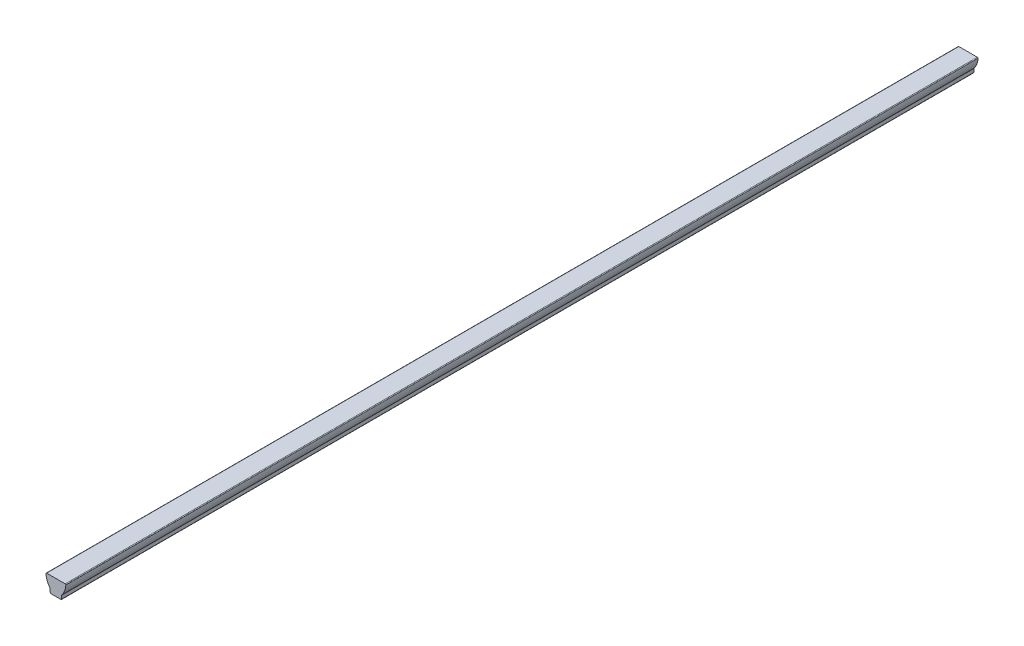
ISO-10303-21;
HEADER;
FILE_DESCRIPTION(('STEP AP214'),'2;1');
FILE_NAME('part.step','',(''),(''),'','','');
FILE_SCHEMA(('AUTOMOTIVE_DESIGN { 1 0 10303 214 1 1 1 1 }'));
ENDSEC;
DATA;
#1=APPLICATION_CONTEXT('core data for automotive mechanical design processes');
#2=APPLICATION_PROTOCOL_DEFINITION('international standard','automotive_design',2000,#1);
#3=PRODUCT_CONTEXT('',#1,'mechanical');
#4=PRODUCT('Part','Part','',(#3));
#5=PRODUCT_RELATED_PRODUCT_CATEGORY('part','',(#4));
#6=PRODUCT_DEFINITION_FORMATION('','',#4);
#7=PRODUCT_DEFINITION_CONTEXT('part definition',#1,'design');
#8=PRODUCT_DEFINITION('design','',#6,#7);
#9=PRODUCT_DEFINITION_SHAPE('','',#8);
#10=(LENGTH_UNIT() NAMED_UNIT(*) SI_UNIT(.MILLI.,.METRE.));
#11=(NAMED_UNIT(*) PLANE_ANGLE_UNIT() SI_UNIT($,.RADIAN.));
#12=(NAMED_UNIT(*) SI_UNIT($,.STERADIAN.) SOLID_ANGLE_UNIT());
#13=UNCERTAINTY_MEASURE_WITH_UNIT(LENGTH_MEASURE(1.E-05),#10,'distance_accuracy_value','');
#14=(GEOMETRIC_REPRESENTATION_CONTEXT(3) GLOBAL_UNCERTAINTY_ASSIGNED_CONTEXT((#13)) GLOBAL_UNIT_ASSIGNED_CONTEXT((#10,
#11,#12)) REPRESENTATION_CONTEXT('',''));
#15=CARTESIAN_POINT('',(0.,0.,0.));
#16=DIRECTION('',(0.,0.,1.));
#17=DIRECTION('',(1.,0.,0.));
#18=AXIS2_PLACEMENT_3D('',#15,#16,#17);
#19=CARTESIAN_POINT('',(-5.14847834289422,8.3566,508.));
#20=DIRECTION('',(0.,0.,-1.));
#21=DIRECTION('',(-1.,0.,0.));
#22=AXIS2_PLACEMENT_3D('',#19,#20,#21);
#23=CYLINDRICAL_SURFACE('',#22,0.381);
#24=CARTESIAN_POINT('',(-5.14847834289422,8.3566,0.));
#25=DIRECTION('',(0.,0.,1.));
#26=DIRECTION('',(-1.,0.,0.));
#27=AXIS2_PLACEMENT_3D('',#24,#25,#26);
#28=CIRCLE('',#27,0.381);
#29=CARTESIAN_POINT('',(-5.14847834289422,8.7376,0.));
#30=VERTEX_POINT('',#29);
#31=CARTESIAN_POINT('',(-5.52916548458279,8.34116302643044,0.));
#32=VERTEX_POINT('',#31);
#33=EDGE_CURVE('E106',#30,#32,#28,.T.);
#34=ORIENTED_EDGE('',*,*,#33,.T.);
#35=DIRECTION('',(0.,0.,-1.));
#36=VECTOR('',#35,1.);
#37=CARTESIAN_POINT('',(-5.52916548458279,8.34116302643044,508.));
#38=LINE('',#37,#36);
#39=CARTESIAN_POINT('',(-5.52916548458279,8.34116302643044,508.));
#40=VERTEX_POINT('',#39);
#41=EDGE_CURVE('E9',#40,#32,#38,.T.);
#42=ORIENTED_EDGE('',*,*,#41,.F.);
#43=CARTESIAN_POINT('',(-5.14847834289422,8.3566,508.));
#44=DIRECTION('',(0.,0.,1.));
#45=DIRECTION('',(-1.,0.,0.));
#46=AXIS2_PLACEMENT_3D('',#43,#44,#45);
#47=CIRCLE('',#46,0.381);
#48=CARTESIAN_POINT('',(-5.14847834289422,8.7376,508.));
#49=VERTEX_POINT('',#48);
#50=EDGE_CURVE('E141',#49,#40,#47,.T.);
#51=ORIENTED_EDGE('',*,*,#50,.F.);
#52=DIRECTION('',(0.,0.,-1.));
#53=VECTOR('',#52,1.);
#54=CARTESIAN_POINT('',(-5.14847834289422,8.7376,508.));
#55=LINE('',#54,#53);
#56=EDGE_CURVE('E119',#49,#30,#55,.T.);
#57=ORIENTED_EDGE('',*,*,#56,.T.);
#58=EDGE_LOOP('',(#34,#42,#51,#57));
#59=FACE_BOUND('',#58,.T.);
#60=ADVANCED_FACE('F14',(#59),#23,.T.);
#61=CARTESIAN_POINT('',(4.2472623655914,8.7376,508.));
#62=DIRECTION('',(0.,0.,-1.));
#63=DIRECTION('',(-1.,0.,0.));
#64=AXIS2_PLACEMENT_3D('',#61,#62,#63);
#65=CYLINDRICAL_SURFACE('',#64,9.7844623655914);
#66=CARTESIAN_POINT('',(4.2472623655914,8.7376,0.));
#67=DIRECTION('',(0.,0.,1.));
#68=DIRECTION('',(1.,0.,0.));
#69=AXIS2_PLACEMENT_3D('',#66,#67,#68);
#70=CIRCLE('',#69,9.7844623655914);
#71=CARTESIAN_POINT('',(-3.26353490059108,2.46674453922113,0.));
#72=VERTEX_POINT('',#71);
#73=EDGE_CURVE('E102',#32,#72,#70,.T.);
#74=ORIENTED_EDGE('',*,*,#73,.T.);
#75=DIRECTION('',(0.,0.,-1.));
#76=VECTOR('',#75,1.);
#77=CARTESIAN_POINT('',(-3.26353490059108,2.46674453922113,508.));
#78=LINE('',#77,#76);
#79=CARTESIAN_POINT('',(-3.26353490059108,2.46674453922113,508.));
#80=VERTEX_POINT('',#79);
#81=EDGE_CURVE('E21',#80,#72,#78,.T.);
#82=ORIENTED_EDGE('',*,*,#81,.F.);
#83=CARTESIAN_POINT('',(4.2472623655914,8.7376,508.));
#84=DIRECTION('',(0.,0.,1.));
#85=DIRECTION('',(1.,0.,0.));
#86=AXIS2_PLACEMENT_3D('',#83,#84,#85);
#87=CIRCLE('',#86,9.7844623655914);
#88=EDGE_CURVE('E115',#40,#80,#87,.T.);
#89=ORIENTED_EDGE('',*,*,#88,.F.);
#90=ORIENTED_EDGE('',*,*,#41,.T.);
#91=EDGE_LOOP('',(#74,#82,#89,#90));
#92=FACE_BOUND('',#91,.T.);
#93=ADVANCED_FACE('F114',(#92),#65,.T.);
#94=CARTESIAN_POINT('',(-3.556,2.22256189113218,508.));
#95=DIRECTION('',(0.,0.,-1.));
#96=DIRECTION('',(-1.,0.,0.));
#97=AXIS2_PLACEMENT_3D('',#94,#95,#96);
#98=CYLINDRICAL_SURFACE('',#97,0.381);
#99=CARTESIAN_POINT('',(-3.556,2.22256189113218,0.));
#100=DIRECTION('',(0.,0.,-1.));
#101=DIRECTION('',(-1.,0.,0.));
#102=AXIS2_PLACEMENT_3D('',#99,#100,#101);
#103=CIRCLE('',#102,0.381);
#104=CARTESIAN_POINT('',(-3.175,2.22256189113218,0.));
#105=VERTEX_POINT('',#104);
#106=EDGE_CURVE('E108',#72,#105,#103,.T.);
#107=ORIENTED_EDGE('',*,*,#106,.T.);
#108=DIRECTION('',(0.,0.,-1.));
#109=VECTOR('',#108,1.);
#110=CARTESIAN_POINT('',(-3.175,2.22256189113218,508.));
#111=LINE('',#110,#109);
#112=CARTESIAN_POINT('',(-3.175,2.22256189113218,508.));
#113=VERTEX_POINT('',#112);
#114=EDGE_CURVE('E187',#113,#105,#111,.T.);
#115=ORIENTED_EDGE('',*,*,#114,.F.);
#116=CARTESIAN_POINT('',(-3.556,2.22256189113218,508.));
#117=DIRECTION('',(0.,0.,-1.));
#118=DIRECTION('',(-1.,0.,0.));
#119=AXIS2_PLACEMENT_3D('',#116,#117,#118);
#120=CIRCLE('',#119,0.381);
#121=EDGE_CURVE('E144',#80,#113,#120,.T.);
#122=ORIENTED_EDGE('',*,*,#121,.F.);
#123=ORIENTED_EDGE('',*,*,#81,.T.);
#124=EDGE_LOOP('',(#107,#115,#122,#123));
#125=FACE_BOUND('',#124,.T.);
#126=ADVANCED_FACE('F191',(#125),#98,.F.);
#127=CARTESIAN_POINT('',(-3.175,0.381,508.));
#128=DIRECTION('',(1.,0.,0.));
#129=DIRECTION('',(0.,1.,0.));
#130=AXIS2_PLACEMENT_3D('',#127,#128,#129);
#131=PLANE('',#130);
#132=DIRECTION('',(0.,-1.,0.));
#133=VECTOR('',#132,1.);
#134=CARTESIAN_POINT('',(-3.175,0.381,0.));
#135=LINE('',#134,#133);
#136=CARTESIAN_POINT('',(-3.175,0.381,0.));
#137=VERTEX_POINT('',#136);
#138=EDGE_CURVE('E123',#105,#137,#135,.T.);
#139=ORIENTED_EDGE('',*,*,#138,.T.);
#140=DIRECTION('',(0.,0.,-1.));
#141=VECTOR('',#140,1.);
#142=CARTESIAN_POINT('',(-3.175,0.381,508.));
#143=LINE('',#142,#141);
#144=CARTESIAN_POINT('',(-3.175,0.381,508.));
#145=VERTEX_POINT('',#144);
#146=EDGE_CURVE('E184',#145,#137,#143,.T.);
#147=ORIENTED_EDGE('',*,*,#146,.F.);
#148=DIRECTION('',(0.,-1.,0.));
#149=VECTOR('',#148,1.);
#150=CARTESIAN_POINT('',(-3.175,0.381,508.));
#151=LINE('',#150,#149);
#152=EDGE_CURVE('E146',#113,#145,#151,.T.);
#153=ORIENTED_EDGE('',*,*,#152,.F.);
#154=ORIENTED_EDGE('',*,*,#114,.T.);
#155=EDGE_LOOP('',(#139,#147,#153,#154));
#156=FACE_BOUND('',#155,.T.);
#157=ADVANCED_FACE('F199',(#156),#131,.F.);
#158=CARTESIAN_POINT('',(-2.794,0.381,508.));
#159=DIRECTION('',(0.,0.,-1.));
#160=DIRECTION('',(-1.,0.,0.));
#161=AXIS2_PLACEMENT_3D('',#158,#159,#160);
#162=CYLINDRICAL_SURFACE('',#161,0.381);
#163=CARTESIAN_POINT('',(-2.794,0.381,0.));
#164=DIRECTION('',(0.,0.,1.));
#165=DIRECTION('',(1.,0.,0.));
#166=AXIS2_PLACEMENT_3D('',#163,#164,#165);
#167=CIRCLE('',#166,0.381);
#168=CARTESIAN_POINT('',(-2.794,0.,0.));
#169=VERTEX_POINT('',#168);
#170=EDGE_CURVE('E125',#137,#169,#167,.T.);
#171=ORIENTED_EDGE('',*,*,#170,.T.);
#172=DIRECTION('',(0.,0.,-1.));
#173=VECTOR('',#172,1.);
#174=CARTESIAN_POINT('',(-2.794,0.,508.));
#175=LINE('',#174,#173);
#176=CARTESIAN_POINT('',(-2.794,0.,508.));
#177=VERTEX_POINT('',#176);
#178=EDGE_CURVE('E181',#177,#169,#175,.T.);
#179=ORIENTED_EDGE('',*,*,#178,.F.);
#180=CARTESIAN_POINT('',(-2.794,0.381,508.));
#181=DIRECTION('',(0.,0.,1.));
#182=DIRECTION('',(1.,0.,0.));
#183=AXIS2_PLACEMENT_3D('',#180,#181,#182);
#184=CIRCLE('',#183,0.381);
#185=EDGE_CURVE('E148',#145,#177,#184,.T.);
#186=ORIENTED_EDGE('',*,*,#185,.F.);
#187=ORIENTED_EDGE('',*,*,#146,.T.);
#188=EDGE_LOOP('',(#171,#179,#186,#187));
#189=FACE_BOUND('',#188,.T.);
#190=ADVANCED_FACE('F202',(#189),#162,.T.);
#191=CARTESIAN_POINT('',(-2.794,0.,508.));
#192=DIRECTION('',(0.,1.,0.));
#193=DIRECTION('',(0.,0.,1.));
#194=AXIS2_PLACEMENT_3D('',#191,#192,#193);
#195=PLANE('',#194);
#196=DIRECTION('',(1.,0.,0.));
#197=VECTOR('',#196,1.);
#198=CARTESIAN_POINT('',(-2.794,0.,0.));
#199=LINE('',#198,#197);
#200=CARTESIAN_POINT('',(2.794,0.,0.));
#201=VERTEX_POINT('',#200);
#202=EDGE_CURVE('E127',#169,#201,#199,.T.);
#203=ORIENTED_EDGE('',*,*,#202,.T.);
#204=DIRECTION('',(0.,0.,-1.));
#205=VECTOR('',#204,1.);
#206=CARTESIAN_POINT('',(2.794,0.,508.));
#207=LINE('',#206,#205);
#208=CARTESIAN_POINT('',(2.794,0.,508.));
#209=VERTEX_POINT('',#208);
#210=EDGE_CURVE('E178',#209,#201,#207,.T.);
#211=ORIENTED_EDGE('',*,*,#210,.F.);
#212=DIRECTION('',(1.,0.,0.));
#213=VECTOR('',#212,1.);
#214=CARTESIAN_POINT('',(-2.794,0.,508.));
#215=LINE('',#214,#213);
#216=EDGE_CURVE('E150',#177,#209,#215,.T.);
#217=ORIENTED_EDGE('',*,*,#216,.F.);
#218=ORIENTED_EDGE('',*,*,#178,.T.);
#219=EDGE_LOOP('',(#203,#211,#217,#218));
#220=FACE_BOUND('',#219,.T.);
#221=ADVANCED_FACE('F207',(#220),#195,.F.);
#222=CARTESIAN_POINT('',(2.794,0.381,508.));
#223=DIRECTION('',(0.,0.,-1.));
#224=DIRECTION('',(-1.,0.,0.));
#225=AXIS2_PLACEMENT_3D('',#222,#223,#224);
#226=CYLINDRICAL_SURFACE('',#225,0.381);
#227=CARTESIAN_POINT('',(2.794,0.381,0.));
#228=DIRECTION('',(0.,0.,1.));
#229=DIRECTION('',(1.,0.,0.));
#230=AXIS2_PLACEMENT_3D('',#227,#228,#229);
#231=CIRCLE('',#230,0.381);
#232=CARTESIAN_POINT('',(3.175,0.381,0.));
#233=VERTEX_POINT('',#232);
#234=EDGE_CURVE('E129',#201,#233,#231,.T.);
#235=ORIENTED_EDGE('',*,*,#234,.T.);
#236=DIRECTION('',(0.,0.,-1.));
#237=VECTOR('',#236,1.);
#238=CARTESIAN_POINT('',(3.175,0.381,508.));
#239=LINE('',#238,#237);
#240=CARTESIAN_POINT('',(3.175,0.381,508.));
#241=VERTEX_POINT('',#240);
#242=EDGE_CURVE('E175',#241,#233,#239,.T.);
#243=ORIENTED_EDGE('',*,*,#242,.F.);
#244=CARTESIAN_POINT('',(2.794,0.381,508.));
#245=DIRECTION('',(0.,0.,1.));
#246=DIRECTION('',(1.,0.,0.));
#247=AXIS2_PLACEMENT_3D('',#244,#245,#246);
#248=CIRCLE('',#247,0.381);
#249=EDGE_CURVE('E152',#209,#241,#248,.T.);
#250=ORIENTED_EDGE('',*,*,#249,.F.);
#251=ORIENTED_EDGE('',*,*,#210,.T.);
#252=EDGE_LOOP('',(#235,#243,#250,#251));
#253=FACE_BOUND('',#252,.T.);
#254=ADVANCED_FACE('F213',(#253),#226,.T.);
#255=CARTESIAN_POINT('',(3.175,0.381,508.));
#256=DIRECTION('',(-1.,0.,0.));
#257=DIRECTION('',(0.,-1.,0.));
#258=AXIS2_PLACEMENT_3D('',#255,#256,#257);
#259=PLANE('',#258);
#260=DIRECTION('',(0.,1.,0.));
#261=VECTOR('',#260,1.);
#262=CARTESIAN_POINT('',(3.175,0.381,0.));
#263=LINE('',#262,#261);
#264=CARTESIAN_POINT('',(3.175,2.22256189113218,0.));
#265=VERTEX_POINT('',#264);
#266=EDGE_CURVE('E131',#233,#265,#263,.T.);
#267=ORIENTED_EDGE('',*,*,#266,.T.);
#268=DIRECTION('',(0.,0.,-1.));
#269=VECTOR('',#268,1.);
#270=CARTESIAN_POINT('',(3.175,2.22256189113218,508.));
#271=LINE('',#270,#269);
#272=CARTESIAN_POINT('',(3.175,2.22256189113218,508.));
#273=VERTEX_POINT('',#272);
#274=EDGE_CURVE('E172',#273,#265,#271,.T.);
#275=ORIENTED_EDGE('',*,*,#274,.F.);
#276=DIRECTION('',(0.,1.,0.));
#277=VECTOR('',#276,1.);
#278=CARTESIAN_POINT('',(3.175,0.381,508.));
#279=LINE('',#278,#277);
#280=EDGE_CURVE('E154',#241,#273,#279,.T.);
#281=ORIENTED_EDGE('',*,*,#280,.F.);
#282=ORIENTED_EDGE('',*,*,#242,.T.);
#283=EDGE_LOOP('',(#267,#275,#281,#282));
#284=FACE_BOUND('',#283,.T.);
#285=ADVANCED_FACE('F217',(#284),#259,.F.);
#286=CARTESIAN_POINT('',(3.556,2.22256189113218,508.));
#287=DIRECTION('',(0.,0.,-1.));
#288=DIRECTION('',(-1.,0.,0.));
#289=AXIS2_PLACEMENT_3D('',#286,#287,#288);
#290=CYLINDRICAL_SURFACE('',#289,0.381);
#291=CARTESIAN_POINT('',(3.556,2.22256189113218,0.));
#292=DIRECTION('',(0.,0.,-1.));
#293=DIRECTION('',(-1.,0.,0.));
#294=AXIS2_PLACEMENT_3D('',#291,#292,#293);
#295=CIRCLE('',#294,0.381);
#296=CARTESIAN_POINT('',(3.26353490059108,2.46674453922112,0.));
#297=VERTEX_POINT('',#296);
#298=EDGE_CURVE('E133',#265,#297,#295,.T.);
#299=ORIENTED_EDGE('',*,*,#298,.T.);
#300=DIRECTION('',(0.,0.,-1.));
#301=VECTOR('',#300,1.);
#302=CARTESIAN_POINT('',(3.26353490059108,2.46674453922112,508.));
#303=LINE('',#302,#301);
#304=CARTESIAN_POINT('',(3.26353490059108,2.46674453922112,508.));
#305=VERTEX_POINT('',#304);
#306=EDGE_CURVE('E169',#305,#297,#303,.T.);
#307=ORIENTED_EDGE('',*,*,#306,.F.);
#308=CARTESIAN_POINT('',(3.556,2.22256189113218,508.));
#309=DIRECTION('',(0.,0.,-1.));
#310=DIRECTION('',(-1.,0.,0.));
#311=AXIS2_PLACEMENT_3D('',#308,#309,#310);
#312=CIRCLE('',#311,0.381);
#313=EDGE_CURVE('E156',#273,#305,#312,.T.);
#314=ORIENTED_EDGE('',*,*,#313,.F.);
#315=ORIENTED_EDGE('',*,*,#274,.T.);
#316=EDGE_LOOP('',(#299,#307,#314,#315));
#317=FACE_BOUND('',#316,.T.);
#318=ADVANCED_FACE('F222',(#317),#290,.F.);
#319=CARTESIAN_POINT('',(-4.2472623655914,8.7376,508.));
#320=DIRECTION('',(0.,0.,-1.));
#321=DIRECTION('',(-1.,0.,0.));
#322=AXIS2_PLACEMENT_3D('',#319,#320,#321);
#323=CYLINDRICAL_SURFACE('',#322,9.7844623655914);
#324=CARTESIAN_POINT('',(-4.2472623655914,8.7376,0.));
#325=DIRECTION('',(0.,0.,1.));
#326=DIRECTION('',(-1.,0.,0.));
#327=AXIS2_PLACEMENT_3D('',#324,#325,#326);
#328=CIRCLE('',#327,9.7844623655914);
#329=CARTESIAN_POINT('',(5.52916548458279,8.34116302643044,0.));
#330=VERTEX_POINT('',#329);
#331=EDGE_CURVE('E135',#297,#330,#328,.T.);
#332=ORIENTED_EDGE('',*,*,#331,.T.);
#333=DIRECTION('',(0.,0.,-1.));
#334=VECTOR('',#333,1.);
#335=CARTESIAN_POINT('',(5.52916548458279,8.34116302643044,508.));
#336=LINE('',#335,#334);
#337=CARTESIAN_POINT('',(5.52916548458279,8.34116302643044,508.));
#338=VERTEX_POINT('',#337);
#339=EDGE_CURVE('E166',#338,#330,#336,.T.);
#340=ORIENTED_EDGE('',*,*,#339,.F.);
#341=CARTESIAN_POINT('',(-4.2472623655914,8.7376,508.));
#342=DIRECTION('',(0.,0.,1.));
#343=DIRECTION('',(-1.,0.,0.));
#344=AXIS2_PLACEMENT_3D('',#341,#342,#343);
#345=CIRCLE('',#344,9.7844623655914);
#346=EDGE_CURVE('E158',#305,#338,#345,.T.);
#347=ORIENTED_EDGE('',*,*,#346,.F.);
#348=ORIENTED_EDGE('',*,*,#306,.T.);
#349=EDGE_LOOP('',(#332,#340,#347,#348));
#350=FACE_BOUND('',#349,.T.);
#351=ADVANCED_FACE('F226',(#350),#323,.T.);
#352=CARTESIAN_POINT('',(5.14847834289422,8.3566,508.));
#353=DIRECTION('',(0.,0.,-1.));
#354=DIRECTION('',(-1.,0.,0.));
#355=AXIS2_PLACEMENT_3D('',#352,#353,#354);
#356=CYLINDRICAL_SURFACE('',#355,0.381);
#357=CARTESIAN_POINT('',(5.14847834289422,8.3566,0.));
#358=DIRECTION('',(0.,0.,1.));
#359=DIRECTION('',(-1.,0.,0.));
#360=AXIS2_PLACEMENT_3D('',#357,#358,#359);
#361=CIRCLE('',#360,0.381);
#362=CARTESIAN_POINT('',(5.14847834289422,8.7376,0.));
#363=VERTEX_POINT('',#362);
#364=EDGE_CURVE('E137',#330,#363,#361,.T.);
#365=ORIENTED_EDGE('',*,*,#364,.T.);
#366=DIRECTION('',(0.,0.,-1.));
#367=VECTOR('',#366,1.);
#368=CARTESIAN_POINT('',(5.14847834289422,8.7376,508.));
#369=LINE('',#368,#367);
#370=CARTESIAN_POINT('',(5.14847834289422,8.7376,508.));
#371=VERTEX_POINT('',#370);
#372=EDGE_CURVE('E163',#371,#363,#369,.T.);
#373=ORIENTED_EDGE('',*,*,#372,.F.);
#374=CARTESIAN_POINT('',(5.14847834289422,8.3566,508.));
#375=DIRECTION('',(0.,0.,1.));
#376=DIRECTION('',(-1.,0.,0.));
#377=AXIS2_PLACEMENT_3D('',#374,#375,#376);
#378=CIRCLE('',#377,0.381);
#379=EDGE_CURVE('E33',#338,#371,#378,.T.);
#380=ORIENTED_EDGE('',*,*,#379,.F.);
#381=ORIENTED_EDGE('',*,*,#339,.T.);
#382=EDGE_LOOP('',(#365,#373,#380,#381));
#383=FACE_BOUND('',#382,.T.);
#384=ADVANCED_FACE('F230',(#383),#356,.T.);
#385=CARTESIAN_POINT('',(-5.14847834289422,8.7376,508.));
#386=DIRECTION('',(0.,-1.,0.));
#387=DIRECTION('',(0.,0.,-1.));
#388=AXIS2_PLACEMENT_3D('',#385,#386,#387);
#389=PLANE('',#388);
#390=DIRECTION('',(-1.,0.,0.));
#391=VECTOR('',#390,1.);
#392=CARTESIAN_POINT('',(-5.14847834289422,8.7376,0.));
#393=LINE('',#392,#391);
#394=EDGE_CURVE('E139',#363,#30,#393,.T.);
#395=ORIENTED_EDGE('',*,*,#394,.T.);
#396=ORIENTED_EDGE('',*,*,#56,.F.);
#397=DIRECTION('',(-1.,0.,0.));
#398=VECTOR('',#397,1.);
#399=CARTESIAN_POINT('',(-5.14847834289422,8.7376,508.));
#400=LINE('',#399,#398);
#401=EDGE_CURVE('E28',#371,#49,#400,.T.);
#402=ORIENTED_EDGE('',*,*,#401,.F.);
#403=ORIENTED_EDGE('',*,*,#372,.T.);
#404=EDGE_LOOP('',(#395,#396,#402,#403));
#405=FACE_BOUND('',#404,.T.);
#406=ADVANCED_FACE('F232',(#405),#389,.F.);
#407=CARTESIAN_POINT('',(-5.14847834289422,8.3566,508.));
#408=DIRECTION('',(0.,0.,-1.));
#409=DIRECTION('',(-1.,0.,0.));
#410=AXIS2_PLACEMENT_3D('',#407,#408,#409);
#411=PLANE('',#410);
#412=ORIENTED_EDGE('',*,*,#50,.T.);
#413=ORIENTED_EDGE('',*,*,#88,.T.);
#414=ORIENTED_EDGE('',*,*,#121,.T.);
#415=ORIENTED_EDGE('',*,*,#152,.T.);
#416=ORIENTED_EDGE('',*,*,#185,.T.);
#417=ORIENTED_EDGE('',*,*,#216,.T.);
#418=ORIENTED_EDGE('',*,*,#249,.T.);
#419=ORIENTED_EDGE('',*,*,#280,.T.);
#420=ORIENTED_EDGE('',*,*,#313,.T.);
#421=ORIENTED_EDGE('',*,*,#346,.T.);
#422=ORIENTED_EDGE('',*,*,#379,.T.);
#423=ORIENTED_EDGE('',*,*,#401,.T.);
#424=EDGE_LOOP('',(#412,#413,#414,#415,#416,#417,#418,#419,#420,#421,#422,#423));
#425=FACE_BOUND('',#424,.T.);
#426=ADVANCED_FACE('F194',(#425),#411,.F.);
#427=CARTESIAN_POINT('',(-5.14847834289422,8.3566,0.));
#428=DIRECTION('',(0.,0.,-1.));
#429=DIRECTION('',(-1.,0.,0.));
#430=AXIS2_PLACEMENT_3D('',#427,#428,#429);
#431=PLANE('',#430);
#432=ORIENTED_EDGE('',*,*,#33,.F.);
#433=ORIENTED_EDGE('',*,*,#394,.F.);
#434=ORIENTED_EDGE('',*,*,#364,.F.);
#435=ORIENTED_EDGE('',*,*,#331,.F.);
#436=ORIENTED_EDGE('',*,*,#298,.F.);
#437=ORIENTED_EDGE('',*,*,#266,.F.);
#438=ORIENTED_EDGE('',*,*,#234,.F.);
#439=ORIENTED_EDGE('',*,*,#202,.F.);
#440=ORIENTED_EDGE('',*,*,#170,.F.);
#441=ORIENTED_EDGE('',*,*,#138,.F.);
#442=ORIENTED_EDGE('',*,*,#106,.F.);
#443=ORIENTED_EDGE('',*,*,#73,.F.);
#444=EDGE_LOOP('',(#432,#433,#434,#435,#436,#437,#438,#439,#440,#441,#442,#443));
#445=FACE_BOUND('',#444,.T.);
#446=ADVANCED_FACE('F103',(#445),#431,.T.);
#447=CLOSED_SHELL('',(#60,#93,#126,#157,#190,#221,#254,#285,#318,#351,#384,#406,#426,#446));
#448=MANIFOLD_SOLID_BREP('B1',#447);
#449=ADVANCED_BREP_SHAPE_REPRESENTATION('',(#18,#448),#14);
#450=SHAPE_DEFINITION_REPRESENTATION(#9,#449);
ENDSEC;
END-ISO-10303-21;
